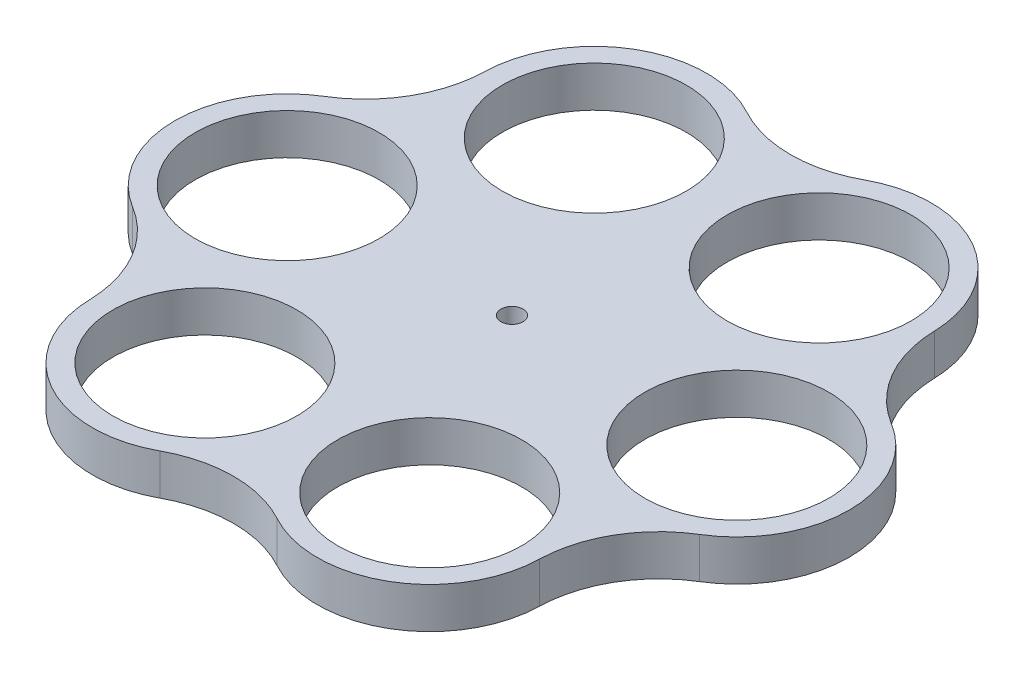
ISO-10303-21;
HEADER;
FILE_DESCRIPTION(('STEP AP214'),'2;1');
FILE_NAME('part.step','',(''),(''),'','','');
FILE_SCHEMA(('AUTOMOTIVE_DESIGN { 1 0 10303 214 1 1 1 1 }'));
ENDSEC;
DATA;
#1=APPLICATION_CONTEXT('core data for automotive mechanical design processes');
#2=APPLICATION_PROTOCOL_DEFINITION('international standard','automotive_design',2000,#1);
#3=PRODUCT_CONTEXT('',#1,'mechanical');
#4=PRODUCT('Part','Part','',(#3));
#5=PRODUCT_RELATED_PRODUCT_CATEGORY('part','',(#4));
#6=PRODUCT_DEFINITION_FORMATION('','',#4);
#7=PRODUCT_DEFINITION_CONTEXT('part definition',#1,'design');
#8=PRODUCT_DEFINITION('design','',#6,#7);
#9=PRODUCT_DEFINITION_SHAPE('','',#8);
#10=(LENGTH_UNIT() NAMED_UNIT(*) SI_UNIT(.MILLI.,.METRE.));
#11=(NAMED_UNIT(*) PLANE_ANGLE_UNIT() SI_UNIT($,.RADIAN.));
#12=(NAMED_UNIT(*) SI_UNIT($,.STERADIAN.) SOLID_ANGLE_UNIT());
#13=UNCERTAINTY_MEASURE_WITH_UNIT(LENGTH_MEASURE(1.E-05),#10,'distance_accuracy_value','');
#14=(GEOMETRIC_REPRESENTATION_CONTEXT(3) GLOBAL_UNCERTAINTY_ASSIGNED_CONTEXT((#13)) GLOBAL_UNIT_ASSIGNED_CONTEXT((#10,
#11,#12)) REPRESENTATION_CONTEXT('',''));
#15=CARTESIAN_POINT('',(0.,0.,0.));
#16=DIRECTION('',(0.,0.,1.));
#17=DIRECTION('',(1.,0.,0.));
#18=AXIS2_PLACEMENT_3D('',#15,#16,#17);
#19=CARTESIAN_POINT('',(84.9821392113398,10.,49.0644609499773));
#20=DIRECTION('',(0.,-1.,0.));
#21=DIRECTION('',(0.,0.,-1.));
#22=AXIS2_PLACEMENT_3D('',#19,#20,#21);
#23=CYLINDRICAL_SURFACE('',#22,30.);
#24=CARTESIAN_POINT('',(84.9821392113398,0.,49.0644609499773));
#25=DIRECTION('',(0.,1.,0.));
#26=DIRECTION('',(0.,0.,1.));
#27=AXIS2_PLACEMENT_3D('',#24,#25,#26);
#28=CIRCLE('',#27,30.);
#29=CARTESIAN_POINT('',(69.3392839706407,0.,23.4656117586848));
#30=VERTEX_POINT('',#29);
#31=CARTESIAN_POINT('',(54.9914578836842,0.,48.3167755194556));
#32=VERTEX_POINT('',#31);
#33=EDGE_CURVE('E176',#30,#32,#28,.T.);
#34=ORIENTED_EDGE('',*,*,#33,.F.);
#35=DIRECTION('',(0.,-1.,0.));
#36=VECTOR('',#35,1.);
#37=CARTESIAN_POINT('',(69.3392839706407,10.,23.4656117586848));
#38=LINE('',#37,#36);
#39=CARTESIAN_POINT('',(69.3392839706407,10.,23.4656117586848));
#40=VERTEX_POINT('',#39);
#41=EDGE_CURVE('E11',#40,#30,#38,.T.);
#42=ORIENTED_EDGE('',*,*,#41,.F.);
#43=CARTESIAN_POINT('',(84.9821392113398,10.,49.0644609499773));
#44=DIRECTION('',(0.,1.,0.));
#45=DIRECTION('',(0.,0.,1.));
#46=AXIS2_PLACEMENT_3D('',#43,#44,#45);
#47=CIRCLE('',#46,30.);
#48=CARTESIAN_POINT('',(54.9914578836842,10.,48.3167755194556));
#49=VERTEX_POINT('',#48);
#50=EDGE_CURVE('E265',#40,#49,#47,.T.);
#51=ORIENTED_EDGE('',*,*,#50,.T.);
#52=DIRECTION('',(0.,-1.,0.));
#53=VECTOR('',#52,1.);
#54=CARTESIAN_POINT('',(54.9914578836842,10.,48.3167755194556));
#55=LINE('',#54,#53);
#56=EDGE_CURVE('E99',#49,#32,#55,.T.);
#57=ORIENTED_EDGE('',*,*,#56,.T.);
#58=EDGE_LOOP('',(#34,#42,#51,#57));
#59=FACE_BOUND('',#58,.T.);
#60=ADVANCED_FACE('F36',(#59),#23,.F.);
#61=CARTESIAN_POINT('',(55.,10.,0.));
#62=DIRECTION('',(0.,-1.,0.));
#63=DIRECTION('',(0.,0.,-1.));
#64=AXIS2_PLACEMENT_3D('',#61,#62,#63);
#65=CYLINDRICAL_SURFACE('',#64,27.5);
#66=CARTESIAN_POINT('',(55.,0.,0.));
#67=DIRECTION('',(0.,1.,0.));
#68=DIRECTION('',(0.,0.,1.));
#69=AXIS2_PLACEMENT_3D('',#66,#67,#68);
#70=CIRCLE('',#69,27.5);
#71=CARTESIAN_POINT('',(69.3392839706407,0.,-23.4656117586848));
#72=VERTEX_POINT('',#71);
#73=EDGE_CURVE('E179',#30,#72,#70,.T.);
#74=ORIENTED_EDGE('',*,*,#73,.T.);
#75=DIRECTION('',(0.,-1.,0.));
#76=VECTOR('',#75,1.);
#77=CARTESIAN_POINT('',(69.3392839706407,10.,-23.4656117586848));
#78=LINE('',#77,#76);
#79=CARTESIAN_POINT('',(69.3392839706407,10.,-23.4656117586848));
#80=VERTEX_POINT('',#79);
#81=EDGE_CURVE('E45',#80,#72,#78,.T.);
#82=ORIENTED_EDGE('',*,*,#81,.F.);
#83=CARTESIAN_POINT('',(55.,10.,0.));
#84=DIRECTION('',(0.,1.,0.));
#85=DIRECTION('',(0.,0.,1.));
#86=AXIS2_PLACEMENT_3D('',#83,#84,#85);
#87=CIRCLE('',#86,27.5);
#88=EDGE_CURVE('E263',#40,#80,#87,.T.);
#89=ORIENTED_EDGE('',*,*,#88,.F.);
#90=ORIENTED_EDGE('',*,*,#41,.T.);
#91=EDGE_LOOP('',(#74,#82,#89,#90));
#92=FACE_BOUND('',#91,.T.);
#93=ADVANCED_FACE('F247',(#92),#65,.T.);
#94=CARTESIAN_POINT('',(84.9821392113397,10.,-49.0644609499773));
#95=DIRECTION('',(0.,-1.,0.));
#96=DIRECTION('',(0.,0.,-1.));
#97=AXIS2_PLACEMENT_3D('',#94,#95,#96);
#98=CYLINDRICAL_SURFACE('',#97,30.);
#99=CARTESIAN_POINT('',(84.9821392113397,0.,-49.0644609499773));
#100=DIRECTION('',(0.,1.,0.));
#101=DIRECTION('',(0.,0.,1.));
#102=AXIS2_PLACEMENT_3D('',#99,#100,#101);
#103=CIRCLE('',#102,30.);
#104=CARTESIAN_POINT('',(54.9914578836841,0.,-48.3167755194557));
#105=VERTEX_POINT('',#104);
#106=EDGE_CURVE('E182',#105,#72,#103,.T.);
#107=ORIENTED_EDGE('',*,*,#106,.F.);
#108=DIRECTION('',(0.,-1.,0.));
#109=VECTOR('',#108,1.);
#110=CARTESIAN_POINT('',(54.9914578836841,10.,-48.3167755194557));
#111=LINE('',#110,#109);
#112=CARTESIAN_POINT('',(54.9914578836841,10.,-48.3167755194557));
#113=VERTEX_POINT('',#112);
#114=EDGE_CURVE('E237',#113,#105,#111,.T.);
#115=ORIENTED_EDGE('',*,*,#114,.F.);
#116=CARTESIAN_POINT('',(84.9821392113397,10.,-49.0644609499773));
#117=DIRECTION('',(0.,1.,0.));
#118=DIRECTION('',(0.,0.,1.));
#119=AXIS2_PLACEMENT_3D('',#116,#117,#118);
#120=CIRCLE('',#119,30.);
#121=EDGE_CURVE('E244',#113,#80,#120,.T.);
#122=ORIENTED_EDGE('',*,*,#121,.T.);
#123=ORIENTED_EDGE('',*,*,#81,.T.);
#124=EDGE_LOOP('',(#107,#115,#122,#123));
#125=FACE_BOUND('',#124,.T.);
#126=ADVANCED_FACE('F242',(#125),#98,.F.);
#127=CARTESIAN_POINT('',(27.4999999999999,10.,-47.6313972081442));
#128=DIRECTION('',(0.,-1.,0.));
#129=DIRECTION('',(0.,0.,-1.));
#130=AXIS2_PLACEMENT_3D('',#127,#128,#129);
#131=CYLINDRICAL_SURFACE('',#130,27.5);
#132=CARTESIAN_POINT('',(27.4999999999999,0.,-47.6313972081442));
#133=DIRECTION('',(0.,1.,0.));
#134=DIRECTION('',(0.,0.,1.));
#135=AXIS2_PLACEMENT_3D('',#132,#133,#134);
#136=CIRCLE('',#135,27.5);
#137=CARTESIAN_POINT('',(14.3478260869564,0.,-71.7823872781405));
#138=VERTEX_POINT('',#137);
#139=EDGE_CURVE('E185',#105,#138,#136,.T.);
#140=ORIENTED_EDGE('',*,*,#139,.T.);
#141=DIRECTION('',(0.,-1.,0.));
#142=VECTOR('',#141,1.);
#143=CARTESIAN_POINT('',(14.3478260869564,10.,-71.7823872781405));
#144=LINE('',#143,#142);
#145=CARTESIAN_POINT('',(14.3478260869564,10.,-71.7823872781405));
#146=VERTEX_POINT('',#145);
#147=EDGE_CURVE('E235',#146,#138,#144,.T.);
#148=ORIENTED_EDGE('',*,*,#147,.F.);
#149=CARTESIAN_POINT('',(27.4999999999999,10.,-47.6313972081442));
#150=DIRECTION('',(0.,1.,0.));
#151=DIRECTION('',(0.,0.,1.));
#152=AXIS2_PLACEMENT_3D('',#149,#150,#151);
#153=CIRCLE('',#152,27.5);
#154=EDGE_CURVE('E259',#113,#146,#153,.T.);
#155=ORIENTED_EDGE('',*,*,#154,.F.);
#156=ORIENTED_EDGE('',*,*,#114,.T.);
#157=EDGE_LOOP('',(#140,#148,#155,#156));
#158=FACE_BOUND('',#157,.T.);
#159=ADVANCED_FACE('F256',(#158),#131,.T.);
#160=CARTESIAN_POINT('',(-1.37733608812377E-13,10.,-98.1289218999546));
#161=DIRECTION('',(0.,-1.,0.));
#162=DIRECTION('',(0.,0.,-1.));
#163=AXIS2_PLACEMENT_3D('',#160,#161,#162);
#164=CYLINDRICAL_SURFACE('',#163,30.);
#165=CARTESIAN_POINT('',(-1.37733608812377E-13,0.,-98.1289218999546));
#166=DIRECTION('',(0.,1.,0.));
#167=DIRECTION('',(0.,0.,1.));
#168=AXIS2_PLACEMENT_3D('',#165,#166,#167);
#169=CIRCLE('',#168,30.);
#170=CARTESIAN_POINT('',(-14.3478260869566,0.,-71.7823872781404));
#171=VERTEX_POINT('',#170);
#172=EDGE_CURVE('E188',#171,#138,#169,.T.);
#173=ORIENTED_EDGE('',*,*,#172,.F.);
#174=DIRECTION('',(0.,-1.,0.));
#175=VECTOR('',#174,1.);
#176=CARTESIAN_POINT('',(-14.3478260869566,10.,-71.7823872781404));
#177=LINE('',#176,#175);
#178=CARTESIAN_POINT('',(-14.3478260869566,10.,-71.7823872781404));
#179=VERTEX_POINT('',#178);
#180=EDGE_CURVE('E233',#179,#171,#177,.T.);
#181=ORIENTED_EDGE('',*,*,#180,.F.);
#182=CARTESIAN_POINT('',(-1.37733608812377E-13,10.,-98.1289218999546));
#183=DIRECTION('',(0.,1.,0.));
#184=DIRECTION('',(0.,0.,1.));
#185=AXIS2_PLACEMENT_3D('',#182,#183,#184);
#186=CIRCLE('',#185,30.);
#187=EDGE_CURVE('E261',#179,#146,#186,.T.);
#188=ORIENTED_EDGE('',*,*,#187,.T.);
#189=ORIENTED_EDGE('',*,*,#147,.T.);
#190=EDGE_LOOP('',(#173,#181,#188,#189));
#191=FACE_BOUND('',#190,.T.);
#192=ADVANCED_FACE('F319',(#191),#164,.F.);
#193=CARTESIAN_POINT('',(-27.5,10.,-47.6313972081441));
#194=DIRECTION('',(0.,-1.,0.));
#195=DIRECTION('',(0.,0.,-1.));
#196=AXIS2_PLACEMENT_3D('',#193,#194,#195);
#197=CYLINDRICAL_SURFACE('',#196,27.5);
#198=CARTESIAN_POINT('',(-27.5,0.,-47.6313972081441));
#199=DIRECTION('',(0.,1.,0.));
#200=DIRECTION('',(0.,0.,1.));
#201=AXIS2_PLACEMENT_3D('',#198,#199,#200);
#202=CIRCLE('',#201,27.5);
#203=CARTESIAN_POINT('',(-54.9914578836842,0.,-48.3167755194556));
#204=VERTEX_POINT('',#203);
#205=EDGE_CURVE('E191',#171,#204,#202,.T.);
#206=ORIENTED_EDGE('',*,*,#205,.T.);
#207=DIRECTION('',(0.,-1.,0.));
#208=VECTOR('',#207,1.);
#209=CARTESIAN_POINT('',(-54.9914578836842,10.,-48.3167755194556));
#210=LINE('',#209,#208);
#211=CARTESIAN_POINT('',(-54.9914578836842,10.,-48.3167755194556));
#212=VERTEX_POINT('',#211);
#213=EDGE_CURVE('E231',#212,#204,#210,.T.);
#214=ORIENTED_EDGE('',*,*,#213,.F.);
#215=CARTESIAN_POINT('',(-27.5,10.,-47.6313972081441));
#216=DIRECTION('',(0.,1.,0.));
#217=DIRECTION('',(0.,0.,1.));
#218=AXIS2_PLACEMENT_3D('',#215,#216,#217);
#219=CIRCLE('',#218,27.5);
#220=EDGE_CURVE('E270',#179,#212,#219,.T.);
#221=ORIENTED_EDGE('',*,*,#220,.F.);
#222=ORIENTED_EDGE('',*,*,#180,.T.);
#223=EDGE_LOOP('',(#206,#214,#221,#222));
#224=FACE_BOUND('',#223,.T.);
#225=ADVANCED_FACE('F322',(#224),#197,.T.);
#226=CARTESIAN_POINT('',(-84.9821392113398,10.,-49.0644609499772));
#227=DIRECTION('',(0.,-1.,0.));
#228=DIRECTION('',(0.,0.,-1.));
#229=AXIS2_PLACEMENT_3D('',#226,#227,#228);
#230=CYLINDRICAL_SURFACE('',#229,30.);
#231=CARTESIAN_POINT('',(-84.9821392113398,0.,-49.0644609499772));
#232=DIRECTION('',(0.,1.,0.));
#233=DIRECTION('',(0.,0.,1.));
#234=AXIS2_PLACEMENT_3D('',#231,#232,#233);
#235=CIRCLE('',#234,30.);
#236=CARTESIAN_POINT('',(-69.3392839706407,0.,-23.4656117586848));
#237=VERTEX_POINT('',#236);
#238=EDGE_CURVE('E194',#237,#204,#235,.T.);
#239=ORIENTED_EDGE('',*,*,#238,.F.);
#240=DIRECTION('',(0.,-1.,0.));
#241=VECTOR('',#240,1.);
#242=CARTESIAN_POINT('',(-69.3392839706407,10.,-23.4656117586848));
#243=LINE('',#242,#241);
#244=CARTESIAN_POINT('',(-69.3392839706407,10.,-23.4656117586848));
#245=VERTEX_POINT('',#244);
#246=EDGE_CURVE('E229',#245,#237,#243,.T.);
#247=ORIENTED_EDGE('',*,*,#246,.F.);
#248=CARTESIAN_POINT('',(-84.9821392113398,10.,-49.0644609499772));
#249=DIRECTION('',(0.,1.,0.));
#250=DIRECTION('',(0.,0.,1.));
#251=AXIS2_PLACEMENT_3D('',#248,#249,#250);
#252=CIRCLE('',#251,30.);
#253=EDGE_CURVE('E272',#245,#212,#252,.T.);
#254=ORIENTED_EDGE('',*,*,#253,.T.);
#255=ORIENTED_EDGE('',*,*,#213,.T.);
#256=EDGE_LOOP('',(#239,#247,#254,#255));
#257=FACE_BOUND('',#256,.T.);
#258=ADVANCED_FACE('F326',(#257),#230,.F.);
#259=CARTESIAN_POINT('',(-55.,10.,0.));
#260=DIRECTION('',(0.,-1.,0.));
#261=DIRECTION('',(0.,0.,-1.));
#262=AXIS2_PLACEMENT_3D('',#259,#260,#261);
#263=CYLINDRICAL_SURFACE('',#262,27.5);
#264=CARTESIAN_POINT('',(-55.,0.,0.));
#265=DIRECTION('',(0.,1.,0.));
#266=DIRECTION('',(0.,0.,1.));
#267=AXIS2_PLACEMENT_3D('',#264,#265,#266);
#268=CIRCLE('',#267,27.5);
#269=CARTESIAN_POINT('',(-69.3392839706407,0.,23.4656117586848));
#270=VERTEX_POINT('',#269);
#271=EDGE_CURVE('E197',#237,#270,#268,.T.);
#272=ORIENTED_EDGE('',*,*,#271,.T.);
#273=DIRECTION('',(0.,-1.,0.));
#274=VECTOR('',#273,1.);
#275=CARTESIAN_POINT('',(-69.3392839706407,10.,23.4656117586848));
#276=LINE('',#275,#274);
#277=CARTESIAN_POINT('',(-69.3392839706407,10.,23.4656117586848));
#278=VERTEX_POINT('',#277);
#279=EDGE_CURVE('E227',#278,#270,#276,.T.);
#280=ORIENTED_EDGE('',*,*,#279,.F.);
#281=CARTESIAN_POINT('',(-55.,10.,0.));
#282=DIRECTION('',(0.,1.,0.));
#283=DIRECTION('',(0.,0.,1.));
#284=AXIS2_PLACEMENT_3D('',#281,#282,#283);
#285=CIRCLE('',#284,27.5);
#286=EDGE_CURVE('E275',#245,#278,#285,.T.);
#287=ORIENTED_EDGE('',*,*,#286,.F.);
#288=ORIENTED_EDGE('',*,*,#246,.T.);
#289=EDGE_LOOP('',(#272,#280,#287,#288));
#290=FACE_BOUND('',#289,.T.);
#291=ADVANCED_FACE('F330',(#290),#263,.T.);
#292=CARTESIAN_POINT('',(-84.9821392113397,10.,49.0644609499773));
#293=DIRECTION('',(0.,-1.,0.));
#294=DIRECTION('',(0.,0.,-1.));
#295=AXIS2_PLACEMENT_3D('',#292,#293,#294);
#296=CYLINDRICAL_SURFACE('',#295,30.);
#297=CARTESIAN_POINT('',(-84.9821392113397,0.,49.0644609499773));
#298=DIRECTION('',(0.,1.,0.));
#299=DIRECTION('',(0.,0.,1.));
#300=AXIS2_PLACEMENT_3D('',#297,#298,#299);
#301=CIRCLE('',#300,30.);
#302=CARTESIAN_POINT('',(-54.9914578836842,0.,48.3167755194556));
#303=VERTEX_POINT('',#302);
#304=EDGE_CURVE('E200',#303,#270,#301,.T.);
#305=ORIENTED_EDGE('',*,*,#304,.F.);
#306=DIRECTION('',(0.,-1.,0.));
#307=VECTOR('',#306,1.);
#308=CARTESIAN_POINT('',(-54.9914578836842,10.,48.3167755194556));
#309=LINE('',#308,#307);
#310=CARTESIAN_POINT('',(-54.9914578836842,10.,48.3167755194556));
#311=VERTEX_POINT('',#310);
#312=EDGE_CURVE('E148',#311,#303,#309,.T.);
#313=ORIENTED_EDGE('',*,*,#312,.F.);
#314=CARTESIAN_POINT('',(-84.9821392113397,10.,49.0644609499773));
#315=DIRECTION('',(0.,1.,0.));
#316=DIRECTION('',(0.,0.,1.));
#317=AXIS2_PLACEMENT_3D('',#314,#315,#316);
#318=CIRCLE('',#317,30.);
#319=EDGE_CURVE('E137',#311,#278,#318,.T.);
#320=ORIENTED_EDGE('',*,*,#319,.T.);
#321=ORIENTED_EDGE('',*,*,#279,.T.);
#322=EDGE_LOOP('',(#305,#313,#320,#321));
#323=FACE_BOUND('',#322,.T.);
#324=ADVANCED_FACE('F278',(#323),#296,.F.);
#325=CARTESIAN_POINT('',(-27.5,10.,47.6313972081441));
#326=DIRECTION('',(0.,-1.,0.));
#327=DIRECTION('',(0.,0.,-1.));
#328=AXIS2_PLACEMENT_3D('',#325,#326,#327);
#329=CYLINDRICAL_SURFACE('',#328,27.5);
#330=CARTESIAN_POINT('',(-27.5,0.,47.6313972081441));
#331=DIRECTION('',(0.,1.,0.));
#332=DIRECTION('',(0.,0.,1.));
#333=AXIS2_PLACEMENT_3D('',#330,#331,#332);
#334=CIRCLE('',#333,27.5);
#335=CARTESIAN_POINT('',(-14.3478260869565,0.,71.7823872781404));
#336=VERTEX_POINT('',#335);
#337=EDGE_CURVE('E144',#303,#336,#334,.T.);
#338=ORIENTED_EDGE('',*,*,#337,.T.);
#339=DIRECTION('',(0.,-1.,0.));
#340=VECTOR('',#339,1.);
#341=CARTESIAN_POINT('',(-14.3478260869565,10.,71.7823872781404));
#342=LINE('',#341,#340);
#343=CARTESIAN_POINT('',(-14.3478260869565,10.,71.7823872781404));
#344=VERTEX_POINT('',#343);
#345=EDGE_CURVE('E141',#344,#336,#342,.T.);
#346=ORIENTED_EDGE('',*,*,#345,.F.);
#347=CARTESIAN_POINT('',(-27.5,10.,47.6313972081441));
#348=DIRECTION('',(0.,1.,0.));
#349=DIRECTION('',(0.,0.,1.));
#350=AXIS2_PLACEMENT_3D('',#347,#348,#349);
#351=CIRCLE('',#350,27.5);
#352=EDGE_CURVE('E130',#311,#344,#351,.T.);
#353=ORIENTED_EDGE('',*,*,#352,.F.);
#354=ORIENTED_EDGE('',*,*,#312,.T.);
#355=EDGE_LOOP('',(#338,#346,#353,#354));
#356=FACE_BOUND('',#355,.T.);
#357=ADVANCED_FACE('F142',(#356),#329,.T.);
#358=CARTESIAN_POINT('',(0.,10.,98.1289218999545));
#359=DIRECTION('',(0.,-1.,0.));
#360=DIRECTION('',(0.,0.,-1.));
#361=AXIS2_PLACEMENT_3D('',#358,#359,#360);
#362=CYLINDRICAL_SURFACE('',#361,30.);
#363=CARTESIAN_POINT('',(0.,0.,98.1289218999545));
#364=DIRECTION('',(0.,1.,0.));
#365=DIRECTION('',(0.,0.,1.));
#366=AXIS2_PLACEMENT_3D('',#363,#364,#365);
#367=CIRCLE('',#366,30.);
#368=CARTESIAN_POINT('',(14.3478260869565,0.,71.7823872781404));
#369=VERTEX_POINT('',#368);
#370=EDGE_CURVE('E204',#369,#336,#367,.T.);
#371=ORIENTED_EDGE('',*,*,#370,.F.);
#372=DIRECTION('',(0.,-1.,0.));
#373=VECTOR('',#372,1.);
#374=CARTESIAN_POINT('',(14.3478260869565,10.,71.7823872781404));
#375=LINE('',#374,#373);
#376=CARTESIAN_POINT('',(14.3478260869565,10.,71.7823872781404));
#377=VERTEX_POINT('',#376);
#378=EDGE_CURVE('E92',#377,#369,#375,.T.);
#379=ORIENTED_EDGE('',*,*,#378,.F.);
#380=CARTESIAN_POINT('',(0.,10.,98.1289218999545));
#381=DIRECTION('',(0.,1.,0.));
#382=DIRECTION('',(0.,0.,1.));
#383=AXIS2_PLACEMENT_3D('',#380,#381,#382);
#384=CIRCLE('',#383,30.);
#385=EDGE_CURVE('E135',#377,#344,#384,.T.);
#386=ORIENTED_EDGE('',*,*,#385,.T.);
#387=ORIENTED_EDGE('',*,*,#345,.T.);
#388=EDGE_LOOP('',(#371,#379,#386,#387));
#389=FACE_BOUND('',#388,.T.);
#390=ADVANCED_FACE('F150',(#389),#362,.F.);
#391=CARTESIAN_POINT('',(-27.5,10.,-47.6313972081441));
#392=DIRECTION('',(0.,-1.,0.));
#393=DIRECTION('',(0.,0.,-1.));
#394=AXIS2_PLACEMENT_3D('',#391,#392,#393);
#395=CYLINDRICAL_SURFACE('',#394,22.5);
#396=CARTESIAN_POINT('',(-27.5,10.,-47.6313972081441));
#397=DIRECTION('',(0.,1.,0.));
#398=DIRECTION('',(0.,0.,1.));
#399=AXIS2_PLACEMENT_3D('',#396,#397,#398);
#400=CIRCLE('',#399,22.5);
#401=CARTESIAN_POINT('',(-27.5,10.,-25.1313972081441));
#402=VERTEX_POINT('',#401);
#403=EDGE_CURVE('E164',#402,#402,#400,.T.);
#404=ORIENTED_EDGE('',*,*,#403,.T.);
#405=EDGE_LOOP('',(#404));
#406=FACE_BOUND('',#405,.T.);
#407=CARTESIAN_POINT('',(-27.5,0.,-47.6313972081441));
#408=DIRECTION('',(0.,1.,0.));
#409=DIRECTION('',(0.,0.,1.));
#410=AXIS2_PLACEMENT_3D('',#407,#408,#409);
#411=CIRCLE('',#410,22.5);
#412=CARTESIAN_POINT('',(-27.5,0.,-25.1313972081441));
#413=VERTEX_POINT('',#412);
#414=EDGE_CURVE('E217',#413,#413,#411,.T.);
#415=ORIENTED_EDGE('',*,*,#414,.F.);
#416=EDGE_LOOP('',(#415));
#417=FACE_BOUND('',#416,.T.);
#418=ADVANCED_FACE('F341',(#406,#417),#395,.F.);
#419=CARTESIAN_POINT('',(-27.5,10.,47.6313972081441));
#420=DIRECTION('',(0.,-1.,0.));
#421=DIRECTION('',(0.,0.,-1.));
#422=AXIS2_PLACEMENT_3D('',#419,#420,#421);
#423=CYLINDRICAL_SURFACE('',#422,22.5);
#424=CARTESIAN_POINT('',(-27.5,10.,47.6313972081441));
#425=DIRECTION('',(0.,1.,0.));
#426=DIRECTION('',(0.,0.,1.));
#427=AXIS2_PLACEMENT_3D('',#424,#425,#426);
#428=CIRCLE('',#427,22.5);
#429=CARTESIAN_POINT('',(-27.5,10.,70.1313972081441));
#430=VERTEX_POINT('',#429);
#431=EDGE_CURVE('E161',#430,#430,#428,.T.);
#432=ORIENTED_EDGE('',*,*,#431,.T.);
#433=EDGE_LOOP('',(#432));
#434=FACE_BOUND('',#433,.T.);
#435=CARTESIAN_POINT('',(-27.5,0.,47.6313972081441));
#436=DIRECTION('',(0.,1.,0.));
#437=DIRECTION('',(0.,0.,1.));
#438=AXIS2_PLACEMENT_3D('',#435,#436,#437);
#439=CIRCLE('',#438,22.5);
#440=CARTESIAN_POINT('',(-27.5,0.,70.1313972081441));
#441=VERTEX_POINT('',#440);
#442=EDGE_CURVE('E214',#441,#441,#439,.T.);
#443=ORIENTED_EDGE('',*,*,#442,.F.);
#444=EDGE_LOOP('',(#443));
#445=FACE_BOUND('',#444,.T.);
#446=ADVANCED_FACE('F351',(#434,#445),#423,.F.);
#447=CARTESIAN_POINT('',(27.5,10.,47.6313972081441));
#448=DIRECTION('',(0.,-1.,0.));
#449=DIRECTION('',(0.,0.,-1.));
#450=AXIS2_PLACEMENT_3D('',#447,#448,#449);
#451=CYLINDRICAL_SURFACE('',#450,22.5);
#452=CARTESIAN_POINT('',(27.5,10.,47.6313972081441));
#453=DIRECTION('',(0.,1.,0.));
#454=DIRECTION('',(0.,0.,1.));
#455=AXIS2_PLACEMENT_3D('',#452,#453,#454);
#456=CIRCLE('',#455,22.5);
#457=CARTESIAN_POINT('',(27.5,10.,70.1313972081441));
#458=VERTEX_POINT('',#457);
#459=EDGE_CURVE('E158',#458,#458,#456,.T.);
#460=ORIENTED_EDGE('',*,*,#459,.T.);
#461=EDGE_LOOP('',(#460));
#462=FACE_BOUND('',#461,.T.);
#463=CARTESIAN_POINT('',(27.5,0.,47.6313972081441));
#464=DIRECTION('',(0.,1.,0.));
#465=DIRECTION('',(0.,0.,1.));
#466=AXIS2_PLACEMENT_3D('',#463,#464,#465);
#467=CIRCLE('',#466,22.5);
#468=CARTESIAN_POINT('',(27.5,0.,70.1313972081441));
#469=VERTEX_POINT('',#468);
#470=EDGE_CURVE('E211',#469,#469,#467,.T.);
#471=ORIENTED_EDGE('',*,*,#470,.F.);
#472=EDGE_LOOP('',(#471));
#473=FACE_BOUND('',#472,.T.);
#474=ADVANCED_FACE('F347',(#462,#473),#451,.F.);
#475=CARTESIAN_POINT('',(55.,10.,0.));
#476=DIRECTION('',(0.,-1.,0.));
#477=DIRECTION('',(0.,0.,-1.));
#478=AXIS2_PLACEMENT_3D('',#475,#476,#477);
#479=CYLINDRICAL_SURFACE('',#478,22.5);
#480=CARTESIAN_POINT('',(55.,10.,0.));
#481=DIRECTION('',(0.,1.,0.));
#482=DIRECTION('',(0.,0.,1.));
#483=AXIS2_PLACEMENT_3D('',#480,#481,#482);
#484=CIRCLE('',#483,22.5);
#485=CARTESIAN_POINT('',(55.,10.,22.5));
#486=VERTEX_POINT('',#485);
#487=EDGE_CURVE('E152',#486,#486,#484,.T.);
#488=ORIENTED_EDGE('',*,*,#487,.T.);
#489=EDGE_LOOP('',(#488));
#490=FACE_BOUND('',#489,.T.);
#491=CARTESIAN_POINT('',(55.,0.,0.));
#492=DIRECTION('',(0.,1.,0.));
#493=DIRECTION('',(0.,0.,1.));
#494=AXIS2_PLACEMENT_3D('',#491,#492,#493);
#495=CIRCLE('',#494,22.5);
#496=CARTESIAN_POINT('',(55.,0.,22.5));
#497=VERTEX_POINT('',#496);
#498=EDGE_CURVE('E208',#497,#497,#495,.T.);
#499=ORIENTED_EDGE('',*,*,#498,.F.);
#500=EDGE_LOOP('',(#499));
#501=FACE_BOUND('',#500,.T.);
#502=ADVANCED_FACE('F344',(#490,#501),#479,.F.);
#503=CARTESIAN_POINT('',(27.5,10.,47.6313972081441));
#504=DIRECTION('',(0.,-1.,0.));
#505=DIRECTION('',(0.,0.,-1.));
#506=AXIS2_PLACEMENT_3D('',#503,#504,#505);
#507=CYLINDRICAL_SURFACE('',#506,27.5);
#508=CARTESIAN_POINT('',(27.5,0.,47.6313972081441));
#509=DIRECTION('',(0.,1.,0.));
#510=DIRECTION('',(0.,0.,1.));
#511=AXIS2_PLACEMENT_3D('',#508,#509,#510);
#512=CIRCLE('',#511,27.5);
#513=EDGE_CURVE('E206',#369,#32,#512,.T.);
#514=ORIENTED_EDGE('',*,*,#513,.T.);
#515=ORIENTED_EDGE('',*,*,#56,.F.);
#516=CARTESIAN_POINT('',(27.5,10.,47.6313972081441));
#517=DIRECTION('',(0.,1.,0.));
#518=DIRECTION('',(0.,0.,1.));
#519=AXIS2_PLACEMENT_3D('',#516,#517,#518);
#520=CIRCLE('',#519,27.5);
#521=EDGE_CURVE('E53',#377,#49,#520,.T.);
#522=ORIENTED_EDGE('',*,*,#521,.F.);
#523=ORIENTED_EDGE('',*,*,#378,.T.);
#524=EDGE_LOOP('',(#514,#515,#522,#523));
#525=FACE_BOUND('',#524,.T.);
#526=ADVANCED_FACE('F281',(#525),#507,.T.);
#527=CARTESIAN_POINT('',(0.,10.,0.));
#528=DIRECTION('',(0.,-1.,0.));
#529=DIRECTION('',(0.,0.,-1.));
#530=AXIS2_PLACEMENT_3D('',#527,#528,#529);
#531=CYLINDRICAL_SURFACE('',#530,2.69999999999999);
#532=CARTESIAN_POINT('',(0.,10.,0.));
#533=DIRECTION('',(0.,1.,0.));
#534=DIRECTION('',(0.,0.,1.));
#535=AXIS2_PLACEMENT_3D('',#532,#533,#534);
#536=CIRCLE('',#535,2.69999999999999);
#537=CARTESIAN_POINT('',(0.,10.,2.69999999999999));
#538=VERTEX_POINT('',#537);
#539=EDGE_CURVE('E282',#538,#538,#536,.T.);
#540=ORIENTED_EDGE('',*,*,#539,.T.);
#541=EDGE_LOOP('',(#540));
#542=FACE_BOUND('',#541,.T.);
#543=CARTESIAN_POINT('',(0.,0.,0.));
#544=DIRECTION('',(0.,1.,0.));
#545=DIRECTION('',(0.,0.,1.));
#546=AXIS2_PLACEMENT_3D('',#543,#544,#545);
#547=CIRCLE('',#546,2.69999999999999);
#548=CARTESIAN_POINT('',(0.,0.,2.69999999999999));
#549=VERTEX_POINT('',#548);
#550=EDGE_CURVE('E173',#549,#549,#547,.T.);
#551=ORIENTED_EDGE('',*,*,#550,.F.);
#552=EDGE_LOOP('',(#551));
#553=FACE_BOUND('',#552,.T.);
#554=ADVANCED_FACE('F297',(#542,#553),#531,.F.);
#555=CARTESIAN_POINT('',(-55.,10.,0.));
#556=DIRECTION('',(0.,-1.,0.));
#557=DIRECTION('',(0.,0.,-1.));
#558=AXIS2_PLACEMENT_3D('',#555,#556,#557);
#559=CYLINDRICAL_SURFACE('',#558,22.5);
#560=CARTESIAN_POINT('',(-55.,10.,0.));
#561=DIRECTION('',(0.,1.,0.));
#562=DIRECTION('',(0.,0.,1.));
#563=AXIS2_PLACEMENT_3D('',#560,#561,#562);
#564=CIRCLE('',#563,22.5);
#565=CARTESIAN_POINT('',(-55.,10.,22.5));
#566=VERTEX_POINT('',#565);
#567=EDGE_CURVE('E223',#566,#566,#564,.T.);
#568=ORIENTED_EDGE('',*,*,#567,.T.);
#569=EDGE_LOOP('',(#568));
#570=FACE_BOUND('',#569,.T.);
#571=CARTESIAN_POINT('',(-55.,0.,0.));
#572=DIRECTION('',(0.,1.,0.));
#573=DIRECTION('',(0.,0.,1.));
#574=AXIS2_PLACEMENT_3D('',#571,#572,#573);
#575=CIRCLE('',#574,22.5);
#576=CARTESIAN_POINT('',(-55.,0.,22.5));
#577=VERTEX_POINT('',#576);
#578=EDGE_CURVE('E170',#577,#577,#575,.T.);
#579=ORIENTED_EDGE('',*,*,#578,.F.);
#580=EDGE_LOOP('',(#579));
#581=FACE_BOUND('',#580,.T.);
#582=ADVANCED_FACE('F38',(#570,#581),#559,.F.);
#583=CARTESIAN_POINT('',(27.4999999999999,10.,-47.6313972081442));
#584=DIRECTION('',(0.,-1.,0.));
#585=DIRECTION('',(0.,0.,-1.));
#586=AXIS2_PLACEMENT_3D('',#583,#584,#585);
#587=CYLINDRICAL_SURFACE('',#586,22.5);
#588=CARTESIAN_POINT('',(27.4999999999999,10.,-47.6313972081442));
#589=DIRECTION('',(0.,1.,0.));
#590=DIRECTION('',(0.,0.,1.));
#591=AXIS2_PLACEMENT_3D('',#588,#589,#590);
#592=CIRCLE('',#591,22.5);
#593=CARTESIAN_POINT('',(27.4999999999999,10.,-25.1313972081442));
#594=VERTEX_POINT('',#593);
#595=EDGE_CURVE('E167',#594,#594,#592,.T.);
#596=ORIENTED_EDGE('',*,*,#595,.T.);
#597=EDGE_LOOP('',(#596));
#598=FACE_BOUND('',#597,.T.);
#599=CARTESIAN_POINT('',(27.4999999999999,0.,-47.6313972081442));
#600=DIRECTION('',(0.,1.,0.));
#601=DIRECTION('',(0.,0.,1.));
#602=AXIS2_PLACEMENT_3D('',#599,#600,#601);
#603=CIRCLE('',#602,22.5);
#604=CARTESIAN_POINT('',(27.4999999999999,0.,-25.1313972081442));
#605=VERTEX_POINT('',#604);
#606=EDGE_CURVE('E220',#605,#605,#603,.T.);
#607=ORIENTED_EDGE('',*,*,#606,.F.);
#608=EDGE_LOOP('',(#607));
#609=FACE_BOUND('',#608,.T.);
#610=ADVANCED_FACE('F293',(#598,#609),#587,.F.);
#611=CARTESIAN_POINT('',(0.,10.,0.));
#612=DIRECTION('',(0.,1.,0.));
#613=DIRECTION('',(0.,0.,1.));
#614=AXIS2_PLACEMENT_3D('',#611,#612,#613);
#615=PLANE('',#614);
#616=ORIENTED_EDGE('',*,*,#567,.F.);
#617=EDGE_LOOP('',(#616));
#618=FACE_BOUND('',#617,.T.);
#619=ORIENTED_EDGE('',*,*,#539,.F.);
#620=EDGE_LOOP('',(#619));
#621=FACE_BOUND('',#620,.T.);
#622=ORIENTED_EDGE('',*,*,#50,.F.);
#623=ORIENTED_EDGE('',*,*,#88,.T.);
#624=ORIENTED_EDGE('',*,*,#121,.F.);
#625=ORIENTED_EDGE('',*,*,#154,.T.);
#626=ORIENTED_EDGE('',*,*,#187,.F.);
#627=ORIENTED_EDGE('',*,*,#220,.T.);
#628=ORIENTED_EDGE('',*,*,#253,.F.);
#629=ORIENTED_EDGE('',*,*,#286,.T.);
#630=ORIENTED_EDGE('',*,*,#319,.F.);
#631=ORIENTED_EDGE('',*,*,#352,.T.);
#632=ORIENTED_EDGE('',*,*,#385,.F.);
#633=ORIENTED_EDGE('',*,*,#521,.T.);
#634=EDGE_LOOP('',(#622,#623,#624,#625,#626,#627,#628,#629,#630,#631,#632,#633));
#635=FACE_BOUND('',#634,.T.);
#636=ORIENTED_EDGE('',*,*,#487,.F.);
#637=EDGE_LOOP('',(#636));
#638=FACE_BOUND('',#637,.T.);
#639=ORIENTED_EDGE('',*,*,#459,.F.);
#640=EDGE_LOOP('',(#639));
#641=FACE_BOUND('',#640,.T.);
#642=ORIENTED_EDGE('',*,*,#431,.F.);
#643=EDGE_LOOP('',(#642));
#644=FACE_BOUND('',#643,.T.);
#645=ORIENTED_EDGE('',*,*,#403,.F.);
#646=EDGE_LOOP('',(#645));
#647=FACE_BOUND('',#646,.T.);
#648=ORIENTED_EDGE('',*,*,#595,.F.);
#649=EDGE_LOOP('',(#648));
#650=FACE_BOUND('',#649,.T.);
#651=ADVANCED_FACE('F132',(#618,#621,#635,#638,#641,#644,#647,#650),#615,.T.);
#652=CARTESIAN_POINT('',(0.,0.,0.));
#653=DIRECTION('',(0.,1.,0.));
#654=DIRECTION('',(0.,0.,1.));
#655=AXIS2_PLACEMENT_3D('',#652,#653,#654);
#656=PLANE('',#655);
#657=ORIENTED_EDGE('',*,*,#578,.T.);
#658=EDGE_LOOP('',(#657));
#659=FACE_BOUND('',#658,.T.);
#660=ORIENTED_EDGE('',*,*,#550,.T.);
#661=EDGE_LOOP('',(#660));
#662=FACE_BOUND('',#661,.T.);
#663=ORIENTED_EDGE('',*,*,#33,.T.);
#664=ORIENTED_EDGE('',*,*,#513,.F.);
#665=ORIENTED_EDGE('',*,*,#370,.T.);
#666=ORIENTED_EDGE('',*,*,#337,.F.);
#667=ORIENTED_EDGE('',*,*,#304,.T.);
#668=ORIENTED_EDGE('',*,*,#271,.F.);
#669=ORIENTED_EDGE('',*,*,#238,.T.);
#670=ORIENTED_EDGE('',*,*,#205,.F.);
#671=ORIENTED_EDGE('',*,*,#172,.T.);
#672=ORIENTED_EDGE('',*,*,#139,.F.);
#673=ORIENTED_EDGE('',*,*,#106,.T.);
#674=ORIENTED_EDGE('',*,*,#73,.F.);
#675=EDGE_LOOP('',(#663,#664,#665,#666,#667,#668,#669,#670,#671,#672,#673,#674));
#676=FACE_BOUND('',#675,.T.);
#677=ORIENTED_EDGE('',*,*,#498,.T.);
#678=EDGE_LOOP('',(#677));
#679=FACE_BOUND('',#678,.T.);
#680=ORIENTED_EDGE('',*,*,#470,.T.);
#681=EDGE_LOOP('',(#680));
#682=FACE_BOUND('',#681,.T.);
#683=ORIENTED_EDGE('',*,*,#442,.T.);
#684=EDGE_LOOP('',(#683));
#685=FACE_BOUND('',#684,.T.);
#686=ORIENTED_EDGE('',*,*,#414,.T.);
#687=EDGE_LOOP('',(#686));
#688=FACE_BOUND('',#687,.T.);
#689=ORIENTED_EDGE('',*,*,#606,.T.);
#690=EDGE_LOOP('',(#689));
#691=FACE_BOUND('',#690,.T.);
#692=ADVANCED_FACE('F250',(#659,#662,#676,#679,#682,#685,#688,#691),#656,.F.);
#693=CLOSED_SHELL('',(#60,#93,#126,#159,#192,#225,#258,#291,#324,#357,#390,#418,#446,#474,#502,
#526,#554,#582,#610,#651,#692));
#694=MANIFOLD_SOLID_BREP('B2',#693);
#695=ADVANCED_BREP_SHAPE_REPRESENTATION('',(#18,#694),#14);
#696=SHAPE_DEFINITION_REPRESENTATION(#9,#695);
ENDSEC;
END-ISO-10303-21;
